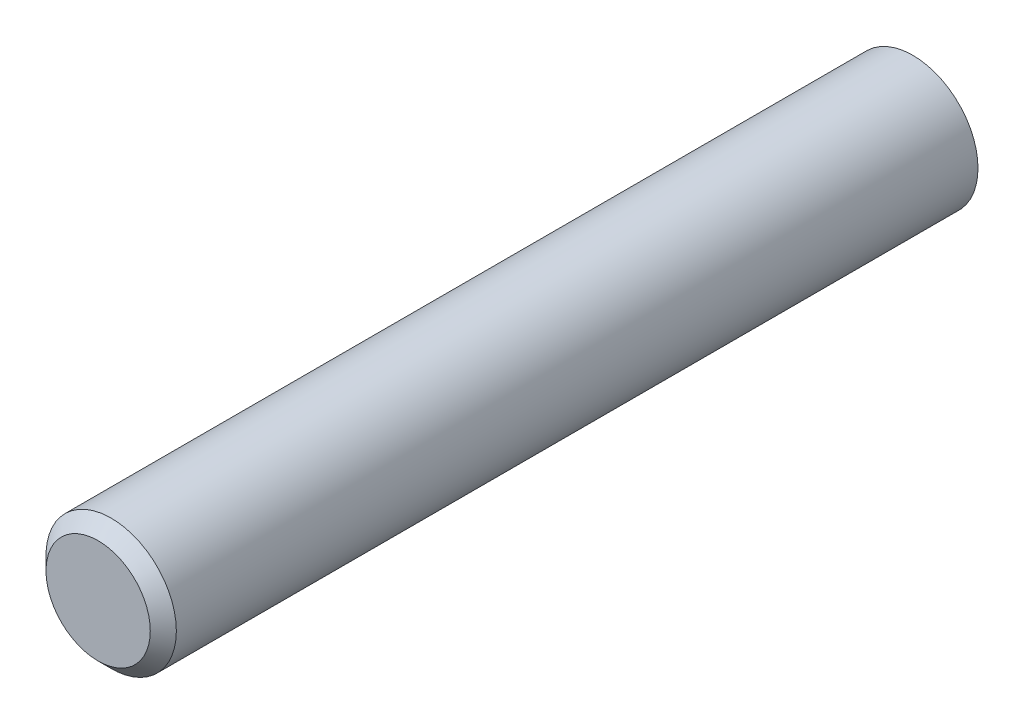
from build123d import *

# Parameters (mm, degrees)
SKETCH1_R           = 4
BOSS_EXTRUDE1_DEPTH = 25
CHAMFER1_SIZE       = 0.8


with BuildPart() as part:
    # Sketch1 → Boss-Extrude1 (new, symmetric)
    with BuildSketch(Plane.XY):
        Circle(SKETCH1_R)
    extrude(amount=BOSS_EXTRUDE1_DEPTH, both=True)

    # Chamfer1
    chamfer1_edges = [part.edges().sort_by_distance(p)[0] for p in [
        (-4, 0, 25),
    ]]
    chamfer(chamfer1_edges, length=CHAMFER1_SIZE)


solid = part.part
